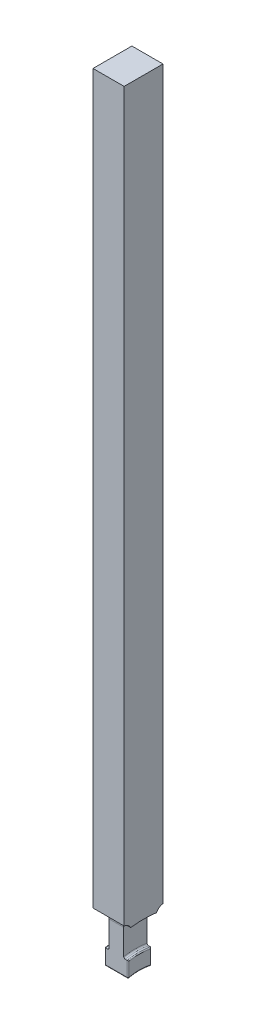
from build123d import *

# Parameters (mm, degrees)
SKETCH1_W               = 10
SKETCH1_H               = 212
BOSS_EXTRUDE1_DEPTH     = 4
CUT_EXTRUDE4_DEPTH      = 213.09667607
CUT_EXTRUDE4_DEPTH_BACK = 213.09667607
SKETCH8_R               = 12
SKETCH2_W               = 2.095
SKETCH2_H               = 8
CUT_EXTRUDE2_DEPTH      = 213.09667607
CUT_EXTRUDE2_DEPTH_BACK = 213.09667607
CUT_EXTRUDE3_DEPTH      = 213.09667607
CUT_EXTRUDE3_DEPTH_BACK = 213.09667607
SKETCH7_W               = 1
SKETCH7_H               = 16
FILLET1_R               = 0.762
FILLET2_R               = 0.381
FILLET3_R               = 0.254


with BuildPart() as part:
    # Sketch1 → Boss-Extrude1 (new, symmetric)
    with BuildSketch(Plane(origin=(0, 0, 0), x_dir=(0, 0, -1), z_dir=(1, 0, 0))):
        with Locations((0, 106)):
            Rectangle(SKETCH1_W, SKETCH1_H)
    extrude(amount=BOSS_EXTRUDE1_DEPTH, both=True)

    # Sketch8 → Cut-Extrude4 (cut, two sides: drawn at the far end of the back side and taken through both)
    with BuildSketch(Plane(origin=(0, 0, 0), x_dir=(0, 0, -1), z_dir=(1, 0, 0)).offset(-CUT_EXTRUDE4_DEPTH_BACK)):
        Circle(SKETCH8_R)
    extrude(amount=CUT_EXTRUDE4_DEPTH + CUT_EXTRUDE4_DEPTH_BACK, mode=Mode.SUBTRACT)

    # Sketch2 → Cut-Revolve1 (revolve, cut)
    with BuildSketch(Plane.XY):
        with Locations((2.9525, 20)):
            Rectangle(SKETCH2_W, SKETCH2_H)
        with Locations((-2.9525, 20)):
            Rectangle(SKETCH2_W, SKETCH2_H)
    revolve(axis=Axis((-8.84822894, 0, 0), (1, 0, 0)), mode=Mode.SUBTRACT)

    # Sketch6 → Cut-Extrude2 (cut, two sides: drawn at the far end of the back side and taken through both)
    with BuildSketch(Plane(origin=(0, 0, 0), x_dir=(0, 0, -1), z_dir=(1, 0, 0)).offset(-CUT_EXTRUDE2_DEPTH_BACK)):
        with BuildLine():
            Line((3, 0), (22.05, 0))
            Line((22.05, 0), (22.05, 25))
            Line((22.05, 25), (5.3876, 25))
            ThreePointArc((5.3876, 25), (3.699311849, 24.300688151), (3, 22.6124))
            Line((3, 22.6124), (3, 0))
        make_face()
        with BuildLine():
            Line((-3, 0), (-22.05, 0))
            Line((-22.05, 0), (-22.05, 25))
            Line((-22.05, 25), (-5.3876, 25))
            ThreePointArc((-5.3876, 25), (-3.699311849, 24.300688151), (-3, 22.6124))
            Line((-3, 22.6124), (-3, 0))
        make_face()
    extrude(amount=CUT_EXTRUDE2_DEPTH + CUT_EXTRUDE2_DEPTH_BACK, mode=Mode.SUBTRACT)

    # Sketch7 → Cut-Extrude3 (cut, two sides: drawn at the far end of the back side and taken through both)
    with BuildSketch(Plane.XY.offset(-CUT_EXTRUDE3_DEPTH_BACK)):
        with Locations((-3.5, 8)):
            Rectangle(SKETCH7_W, SKETCH7_H)
        with Locations((3.5, 8)):
            Rectangle(SKETCH7_W, SKETCH7_H)
    extrude(amount=CUT_EXTRUDE3_DEPTH + CUT_EXTRUDE3_DEPTH_BACK, mode=Mode.SUBTRACT)

    # Fillet1
    fillet1_edges = [part.edges().sort_by_distance(p)[0] for p in [
        (1.905, 24, 0),
        (-1.905, 24, 0),
    ]]
    fillet(fillet1_edges, radius=FILLET1_R)

    # Fillet2
    fillet2_edges = [part.edges().sort_by_distance(p)[0] for p in [
        (1.905, 16, 0),
        (-1.905, 16, 0),
    ]]
    fillet(fillet2_edges, radius=FILLET2_R)

    # Fillet3
    fillet3_edges = [part.edges().sort_by_distance(p)[0] for p in [
        (0, 11.618950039, -3),
        (3, 13.667591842, -3),
        (-3, 13.667591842, -3),
        (0, 11.618950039, 3),
        (-3, 16, 0),
        (-3, 13.667591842, 3),
        (-3, 12, 0),
        (3, 16, 0),
        (3, 12, 0),
        (3, 13.667591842, 3),
    ]]
    fillet(fillet3_edges, radius=FILLET3_R)


solid = part.part
